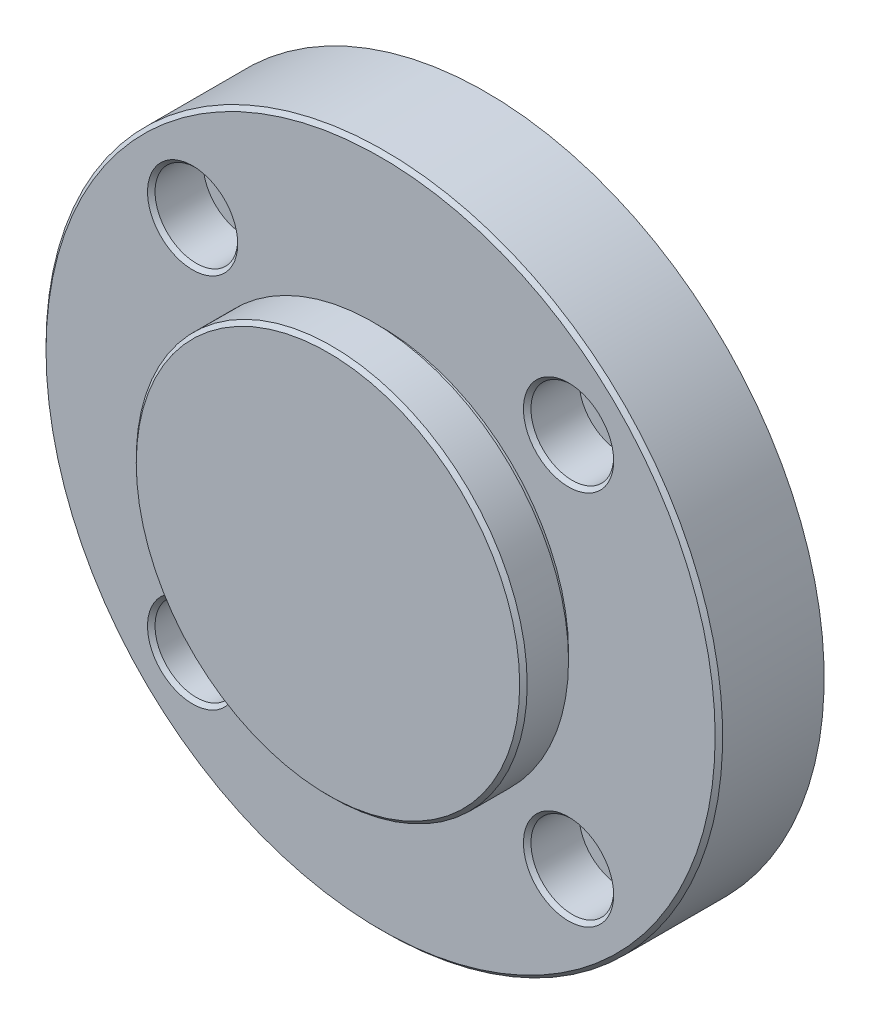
from build123d import *

# Parameters (mm, degrees)
ESQUISSE1_R                                = 45
BOSS_EXTRU_1_DEPTH                         = 21
ESQUISSE2_OUTSIDE_W                        = 117.8
ESQUISSE2_OUTSIDE_H                        = 117.8
ESQUISSE2_OUTSIDE_R                        = 26
ENL_V_MAT_EXTRU_1_DEPTH                    = 7
CHANFREIN1_SIZE                            = 0.5
CHANFREIN2_SIZE                            = 0.5
ESQUISSE3_OUTSIDE_W                        = 117.8
ESQUISSE3_OUTSIDE_H                        = 117.8
ESQUISSE3_OUTSIDE_R                        = 25
ENL_V_MAT_EXTRU_2_DEPTH                    = 1
CHAMBRAGE_POUR_VIS_T_TE_HEXAGONALE_2_COUNT = 2
CHAMBRAGE_POUR_VIS_T_TE_HEXAGONALE_2_PITCH = 50
CHAMBRAGE_POUR_VIS_T_TE_HEXAGONALE_3_COUNT = 2
CHAMBRAGE_POUR_VIS_T_TE_HEXAGONALE_3_PITCH = 70.710678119
CHAMBRAGE_POUR_VIS_T_TE_HEXAGONALE_4_COUNT = 2
CHAMBRAGE_POUR_VIS_T_TE_HEXAGONALE_4_PITCH = 50


with BuildPart() as part:
    # Esquisse1 → Boss.-Extru.1 (new body)
    with BuildSketch(Plane.XY):
        with Locations(Location((0, 0, 0), (0, 0, 180))):
            Circle(ESQUISSE1_R)
    extrude(amount=BOSS_EXTRU_1_DEPTH)

    # Esquisse2 outside → Enl_v. mat.-Extru.1 (cut)
    with BuildSketch(Plane.XY.offset(21)):
        Rectangle(ESQUISSE2_OUTSIDE_W, ESQUISSE2_OUTSIDE_H)
        Circle(ESQUISSE2_OUTSIDE_R, mode=Mode.SUBTRACT)
    extrude(amount=-ENL_V_MAT_EXTRU_1_DEPTH, mode=Mode.SUBTRACT)

    # Chanfrein1
    chanfrein1_edges = [part.edges().sort_by_distance(p)[0] for p in [
        (45, 0, 14),
    ]]
    chamfer(chanfrein1_edges, length=CHANFREIN1_SIZE)

    # Chanfrein2
    chanfrein2_edges = [part.edges().sort_by_distance(p)[0] for p in [
        (-26, 0, 21),
    ]]
    chamfer(chanfrein2_edges, length=CHANFREIN2_SIZE)

    # Esquisse3 outside → Enl_v. mat.-Extru.2 (cut)
    with BuildSketch(Plane.XY.offset(14)):
        Rectangle(ESQUISSE3_OUTSIDE_W, ESQUISSE3_OUTSIDE_H)
        Circle(ESQUISSE3_OUTSIDE_R, mode=Mode.SUBTRACT)
    extrude(amount=ENL_V_MAT_EXTRU_2_DEPTH, mode=Mode.SUBTRACT)

    # Esquisse5 → Chambrage pour vis _ t_te hexagonale M61 (revolve, cut)
    with BuildSketch(Plane(origin=(-25, 25, 14), x_dir=(0, -1, 0), z_dir=(1, 0, 0))):
        Polygon((0, 0), (0, 14), (3.3, 14), (3.3, 6.9), (5.5, 6.9), (5.5, 0.5), (6, 0), align=None)
    chambrage_pour_vis_t_te_hexagonale_m61 = revolve(axis=Axis((-25, 25, 20.35), (0, 0, -1)), mode=Mode.SUBTRACT)

    # Chambrage pour vis _ t_te hexagonale 2: Chambrage pour vis _ t_te hexagonale M61 ×2
    with Locations(*[(i * CHAMBRAGE_POUR_VIS_T_TE_HEXAGONALE_2_PITCH, 0, 0) for i in range(1, CHAMBRAGE_POUR_VIS_T_TE_HEXAGONALE_2_COUNT)]):
        add(chambrage_pour_vis_t_te_hexagonale_m61, mode=Mode.SUBTRACT)

    # Chambrage pour vis _ t_te hexagonale 3: Chambrage pour vis _ t_te hexagonale M61 ×2
    with Locations(*[Vector(0.7071067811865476, -0.7071067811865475, 0) * (i * CHAMBRAGE_POUR_VIS_T_TE_HEXAGONALE_3_PITCH) for i in range(1, CHAMBRAGE_POUR_VIS_T_TE_HEXAGONALE_3_COUNT)]):
        add(chambrage_pour_vis_t_te_hexagonale_m61, mode=Mode.SUBTRACT)

    # Chambrage pour vis _ t_te hexagonale 4: Chambrage pour vis _ t_te hexagonale M61 ×2
    with Locations(*[(0, -i * CHAMBRAGE_POUR_VIS_T_TE_HEXAGONALE_4_PITCH, 0) for i in range(1, CHAMBRAGE_POUR_VIS_T_TE_HEXAGONALE_4_COUNT)]):
        add(chambrage_pour_vis_t_te_hexagonale_m61, mode=Mode.SUBTRACT)


solid = part.part
